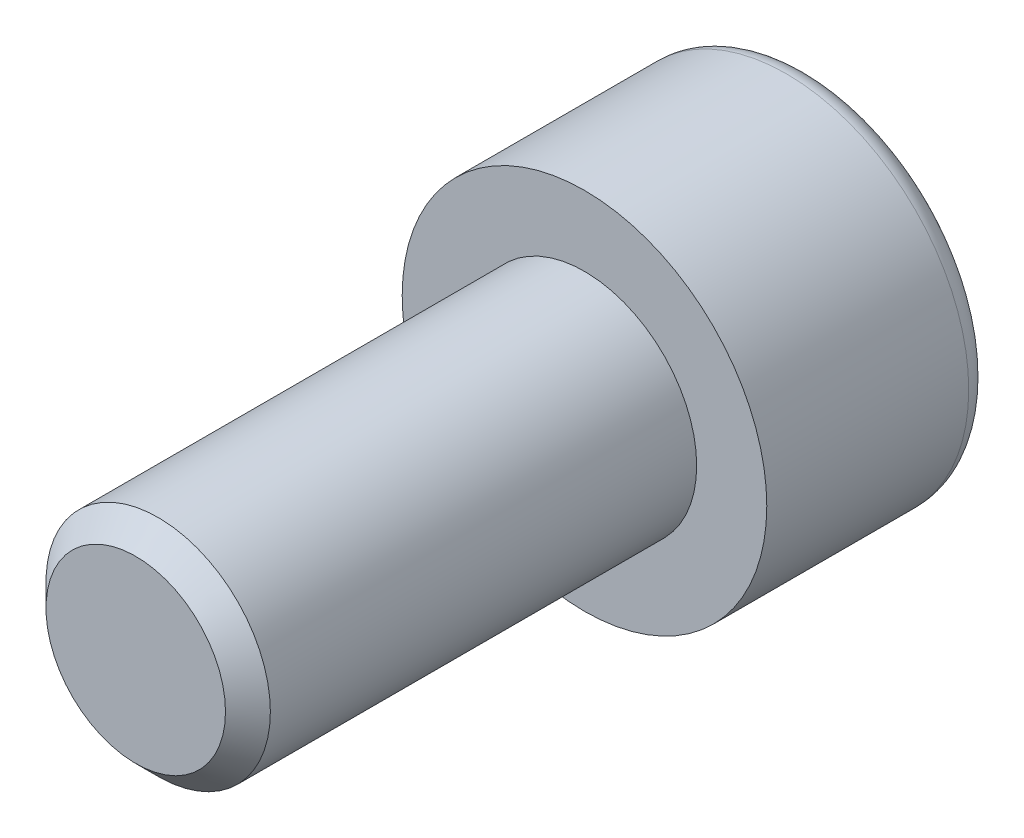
ISO-10303-21;
HEADER;
FILE_DESCRIPTION(('STEP AP214'),'2;1');
FILE_NAME('part.step','',(''),(''),'','','');
FILE_SCHEMA(('AUTOMOTIVE_DESIGN { 1 0 10303 214 1 1 1 1 }'));
ENDSEC;
DATA;
#1=APPLICATION_CONTEXT('core data for automotive mechanical design processes');
#2=APPLICATION_PROTOCOL_DEFINITION('international standard','automotive_design',2000,#1);
#3=PRODUCT_CONTEXT('',#1,'mechanical');
#4=PRODUCT('Part','Part','',(#3));
#5=PRODUCT_RELATED_PRODUCT_CATEGORY('part','',(#4));
#6=PRODUCT_DEFINITION_FORMATION('','',#4);
#7=PRODUCT_DEFINITION_CONTEXT('part definition',#1,'design');
#8=PRODUCT_DEFINITION('design','',#6,#7);
#9=PRODUCT_DEFINITION_SHAPE('','',#8);
#10=(LENGTH_UNIT() NAMED_UNIT(*) SI_UNIT(.MILLI.,.METRE.));
#11=(NAMED_UNIT(*) PLANE_ANGLE_UNIT() SI_UNIT($,.RADIAN.));
#12=(NAMED_UNIT(*) SI_UNIT($,.STERADIAN.) SOLID_ANGLE_UNIT());
#13=UNCERTAINTY_MEASURE_WITH_UNIT(LENGTH_MEASURE(1.E-05),#10,'distance_accuracy_value','');
#14=(GEOMETRIC_REPRESENTATION_CONTEXT(3) GLOBAL_UNCERTAINTY_ASSIGNED_CONTEXT((#13)) GLOBAL_UNIT_ASSIGNED_CONTEXT((#10,
#11,#12)) REPRESENTATION_CONTEXT('',''));
#15=CARTESIAN_POINT('',(0.,0.,0.));
#16=DIRECTION('',(0.,0.,1.));
#17=DIRECTION('',(1.,0.,0.));
#18=AXIS2_PLACEMENT_3D('',#15,#16,#17);
#19=CARTESIAN_POINT('',(0.,0.,-8.));
#20=DIRECTION('',(0.,0.,1.));
#21=DIRECTION('',(1.,0.,0.));
#22=AXIS2_PLACEMENT_3D('',#19,#20,#21);
#23=PLANE('',#22);
#24=CARTESIAN_POINT('',(0.,0.,-8.));
#25=DIRECTION('',(0.,0.,-1.));
#26=DIRECTION('',(-1.,0.,0.));
#27=AXIS2_PLACEMENT_3D('',#24,#25,#26);
#28=CIRCLE('',#27,5.7);
#29=CARTESIAN_POINT('',(-5.7,0.,-8.));
#30=VERTEX_POINT('',#29);
#31=EDGE_CURVE('E140',#30,#30,#28,.T.);
#32=ORIENTED_EDGE('',*,*,#31,.T.);
#33=EDGE_LOOP('',(#32));
#34=FACE_BOUND('',#33,.T.);
#35=DIRECTION('',(-0.86602540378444,0.499999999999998,0.));
#36=VECTOR('',#35,1.);
#37=CARTESIAN_POINT('',(0.,3.46410161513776,-8.));
#38=LINE('',#37,#36);
#39=CARTESIAN_POINT('',(3.,1.73205080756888,-8.));
#40=VERTEX_POINT('',#39);
#41=CARTESIAN_POINT('',(0.,3.46410161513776,-8.));
#42=VERTEX_POINT('',#41);
#43=EDGE_CURVE('E44',#40,#42,#38,.T.);
#44=ORIENTED_EDGE('',*,*,#43,.T.);
#45=DIRECTION('',(-0.866025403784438,-0.500000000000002,0.));
#46=VECTOR('',#45,1.);
#47=CARTESIAN_POINT('',(0.,3.46410161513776,-8.));
#48=LINE('',#47,#46);
#49=CARTESIAN_POINT('',(-3.,1.73205080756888,-8.));
#50=VERTEX_POINT('',#49);
#51=EDGE_CURVE('E84',#42,#50,#48,.T.);
#52=ORIENTED_EDGE('',*,*,#51,.T.);
#53=DIRECTION('',(0.,-1.,0.));
#54=VECTOR('',#53,1.);
#55=CARTESIAN_POINT('',(-3.,-1.73205080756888,-8.));
#56=LINE('',#55,#54);
#57=CARTESIAN_POINT('',(-3.,-1.73205080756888,-8.));
#58=VERTEX_POINT('',#57);
#59=EDGE_CURVE('E92',#50,#58,#56,.T.);
#60=ORIENTED_EDGE('',*,*,#59,.T.);
#61=DIRECTION('',(0.866025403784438,-0.500000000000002,0.));
#62=VECTOR('',#61,1.);
#63=CARTESIAN_POINT('',(0.,-3.46410161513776,-8.));
#64=LINE('',#63,#62);
#65=CARTESIAN_POINT('',(0.,-3.46410161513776,-8.));
#66=VERTEX_POINT('',#65);
#67=EDGE_CURVE('E110',#58,#66,#64,.T.);
#68=ORIENTED_EDGE('',*,*,#67,.T.);
#69=DIRECTION('',(0.86602540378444,0.499999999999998,0.));
#70=VECTOR('',#69,1.);
#71=CARTESIAN_POINT('',(0.,-3.46410161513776,-8.));
#72=LINE('',#71,#70);
#73=CARTESIAN_POINT('',(3.,-1.73205080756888,-8.));
#74=VERTEX_POINT('',#73);
#75=EDGE_CURVE('E113',#66,#74,#72,.T.);
#76=ORIENTED_EDGE('',*,*,#75,.T.);
#77=DIRECTION('',(0.,1.,0.));
#78=VECTOR('',#77,1.);
#79=CARTESIAN_POINT('',(3.,-1.73205080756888,-8.));
#80=LINE('',#79,#78);
#81=EDGE_CURVE('E103',#74,#40,#80,.T.);
#82=ORIENTED_EDGE('',*,*,#81,.T.);
#83=EDGE_LOOP('',(#44,#52,#60,#68,#76,#82));
#84=FACE_BOUND('',#83,.T.);
#85=ADVANCED_FACE('F30',(#34,#84),#23,.F.);
#86=CARTESIAN_POINT('',(0.,0.,-7.2));
#87=DIRECTION('',(0.,0.,-1.));
#88=DIRECTION('',(-1.,0.,0.));
#89=AXIS2_PLACEMENT_3D('',#86,#87,#88);
#90=TOROIDAL_SURFACE('',#89,5.7,0.8);
#91=ORIENTED_EDGE('',*,*,#31,.F.);
#92=EDGE_LOOP('',(#91));
#93=FACE_BOUND('',#92,.T.);
#94=CARTESIAN_POINT('',(0.,0.,-7.2));
#95=DIRECTION('',(0.,0.,-1.));
#96=DIRECTION('',(-1.,0.,0.));
#97=AXIS2_PLACEMENT_3D('',#94,#95,#96);
#98=CIRCLE('',#97,6.5);
#99=CARTESIAN_POINT('',(-6.5,0.,-7.2));
#100=VERTEX_POINT('',#99);
#101=EDGE_CURVE('E137',#100,#100,#98,.T.);
#102=ORIENTED_EDGE('',*,*,#101,.T.);
#103=EDGE_LOOP('',(#102));
#104=FACE_BOUND('',#103,.T.);
#105=ADVANCED_FACE('F159',(#93,#104),#90,.T.);
#106=CARTESIAN_POINT('',(0.,0.,0.));
#107=DIRECTION('',(0.,0.,-1.));
#108=DIRECTION('',(-1.,0.,0.));
#109=AXIS2_PLACEMENT_3D('',#106,#107,#108);
#110=CYLINDRICAL_SURFACE('',#109,6.5);
#111=ORIENTED_EDGE('',*,*,#101,.F.);
#112=EDGE_LOOP('',(#111));
#113=FACE_BOUND('',#112,.T.);
#114=CARTESIAN_POINT('',(0.,0.,0.));
#115=DIRECTION('',(0.,0.,-1.));
#116=DIRECTION('',(-1.,0.,0.));
#117=AXIS2_PLACEMENT_3D('',#114,#115,#116);
#118=CIRCLE('',#117,6.5);
#119=CARTESIAN_POINT('',(-6.5,0.,0.));
#120=VERTEX_POINT('',#119);
#121=EDGE_CURVE('E98',#120,#120,#118,.T.);
#122=ORIENTED_EDGE('',*,*,#121,.T.);
#123=EDGE_LOOP('',(#122));
#124=FACE_BOUND('',#123,.T.);
#125=ADVANCED_FACE('F164',(#113,#124),#110,.T.);
#126=CARTESIAN_POINT('',(0.,0.,0.));
#127=DIRECTION('',(0.,0.,-1.));
#128=DIRECTION('',(-1.,0.,0.));
#129=AXIS2_PLACEMENT_3D('',#126,#127,#128);
#130=PLANE('',#129);
#131=CARTESIAN_POINT('',(0.,0.,0.));
#132=DIRECTION('',(0.,0.,1.));
#133=DIRECTION('',(1.,0.,0.));
#134=AXIS2_PLACEMENT_3D('',#131,#132,#133);
#135=CIRCLE('',#134,4.);
#136=CARTESIAN_POINT('',(4.,0.,0.));
#137=VERTEX_POINT('',#136);
#138=EDGE_CURVE('E104',#137,#137,#135,.T.);
#139=ORIENTED_EDGE('',*,*,#138,.F.);
#140=EDGE_LOOP('',(#139));
#141=FACE_BOUND('',#140,.T.);
#142=ORIENTED_EDGE('',*,*,#121,.F.);
#143=EDGE_LOOP('',(#142));
#144=FACE_BOUND('',#143,.T.);
#145=ADVANCED_FACE('F172',(#141,#144),#130,.F.);
#146=CARTESIAN_POINT('',(0.,3.46410161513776,-4.));
#147=DIRECTION('',(-0.499999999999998,-0.86602540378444,0.));
#148=DIRECTION('',(0.86602540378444,-0.499999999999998,0.));
#149=AXIS2_PLACEMENT_3D('',#146,#147,#148);
#150=PLANE('',#149);
#151=ORIENTED_EDGE('',*,*,#43,.F.);
#152=DIRECTION('',(0.,0.,-1.));
#153=VECTOR('',#152,1.);
#154=CARTESIAN_POINT('',(3.,1.73205080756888,-4.));
#155=LINE('',#154,#153);
#156=CARTESIAN_POINT('',(3.,1.73205080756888,-4.));
#157=VERTEX_POINT('',#156);
#158=EDGE_CURVE('E126',#157,#40,#155,.T.);
#159=ORIENTED_EDGE('',*,*,#158,.F.);
#160=DIRECTION('',(-0.86602540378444,0.499999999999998,0.));
#161=VECTOR('',#160,1.);
#162=CARTESIAN_POINT('',(0.,3.46410161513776,-4.));
#163=LINE('',#162,#161);
#164=CARTESIAN_POINT('',(0.,3.46410161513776,-4.));
#165=VERTEX_POINT('',#164);
#166=EDGE_CURVE('E97',#157,#165,#163,.T.);
#167=ORIENTED_EDGE('',*,*,#166,.T.);
#168=DIRECTION('',(0.,0.,-1.));
#169=VECTOR('',#168,1.);
#170=CARTESIAN_POINT('',(0.,3.46410161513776,-4.));
#171=LINE('',#170,#169);
#172=EDGE_CURVE('E86',#165,#42,#171,.T.);
#173=ORIENTED_EDGE('',*,*,#172,.T.);
#174=EDGE_LOOP('',(#151,#159,#167,#173));
#175=FACE_BOUND('',#174,.T.);
#176=ADVANCED_FACE('F95',(#175),#150,.T.);
#177=CARTESIAN_POINT('',(0.,3.46410161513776,-4.));
#178=DIRECTION('',(0.500000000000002,-0.866025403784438,0.));
#179=DIRECTION('',(0.866025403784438,0.500000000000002,0.));
#180=AXIS2_PLACEMENT_3D('',#177,#178,#179);
#181=PLANE('',#180);
#182=ORIENTED_EDGE('',*,*,#51,.F.);
#183=ORIENTED_EDGE('',*,*,#172,.F.);
#184=DIRECTION('',(-0.866025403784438,-0.500000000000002,0.));
#185=VECTOR('',#184,1.);
#186=CARTESIAN_POINT('',(0.,3.46410161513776,-4.));
#187=LINE('',#186,#185);
#188=CARTESIAN_POINT('',(-3.,1.73205080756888,-4.));
#189=VERTEX_POINT('',#188);
#190=EDGE_CURVE('E117',#165,#189,#187,.T.);
#191=ORIENTED_EDGE('',*,*,#190,.T.);
#192=DIRECTION('',(0.,0.,-1.));
#193=VECTOR('',#192,1.);
#194=CARTESIAN_POINT('',(-3.,1.73205080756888,-4.));
#195=LINE('',#194,#193);
#196=EDGE_CURVE('E88',#189,#50,#195,.T.);
#197=ORIENTED_EDGE('',*,*,#196,.T.);
#198=EDGE_LOOP('',(#182,#183,#191,#197));
#199=FACE_BOUND('',#198,.T.);
#200=ADVANCED_FACE('F85',(#199),#181,.T.);
#201=CARTESIAN_POINT('',(-3.,-1.73205080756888,-4.));
#202=DIRECTION('',(1.,0.,0.));
#203=DIRECTION('',(0.,0.,-1.));
#204=AXIS2_PLACEMENT_3D('',#201,#202,#203);
#205=PLANE('',#204);
#206=ORIENTED_EDGE('',*,*,#59,.F.);
#207=ORIENTED_EDGE('',*,*,#196,.F.);
#208=DIRECTION('',(0.,-1.,0.));
#209=VECTOR('',#208,1.);
#210=CARTESIAN_POINT('',(-3.,-1.73205080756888,-4.));
#211=LINE('',#210,#209);
#212=CARTESIAN_POINT('',(-3.,-1.73205080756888,-4.));
#213=VERTEX_POINT('',#212);
#214=EDGE_CURVE('E119',#189,#213,#211,.T.);
#215=ORIENTED_EDGE('',*,*,#214,.T.);
#216=DIRECTION('',(0.,0.,-1.));
#217=VECTOR('',#216,1.);
#218=CARTESIAN_POINT('',(-3.,-1.73205080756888,-4.));
#219=LINE('',#218,#217);
#220=EDGE_CURVE('E132',#213,#58,#219,.T.);
#221=ORIENTED_EDGE('',*,*,#220,.T.);
#222=EDGE_LOOP('',(#206,#207,#215,#221));
#223=FACE_BOUND('',#222,.T.);
#224=ADVANCED_FACE('F187',(#223),#205,.T.);
#225=CARTESIAN_POINT('',(0.,-3.46410161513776,-4.));
#226=DIRECTION('',(0.500000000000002,0.866025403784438,0.));
#227=DIRECTION('',(-0.866025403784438,0.500000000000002,0.));
#228=AXIS2_PLACEMENT_3D('',#225,#226,#227);
#229=PLANE('',#228);
#230=ORIENTED_EDGE('',*,*,#67,.F.);
#231=ORIENTED_EDGE('',*,*,#220,.F.);
#232=DIRECTION('',(0.866025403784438,-0.500000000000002,0.));
#233=VECTOR('',#232,1.);
#234=CARTESIAN_POINT('',(0.,-3.46410161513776,-4.));
#235=LINE('',#234,#233);
#236=CARTESIAN_POINT('',(0.,-3.46410161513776,-4.));
#237=VERTEX_POINT('',#236);
#238=EDGE_CURVE('E121',#213,#237,#235,.T.);
#239=ORIENTED_EDGE('',*,*,#238,.T.);
#240=DIRECTION('',(0.,0.,-1.));
#241=VECTOR('',#240,1.);
#242=CARTESIAN_POINT('',(0.,-3.46410161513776,-4.));
#243=LINE('',#242,#241);
#244=EDGE_CURVE('E130',#237,#66,#243,.T.);
#245=ORIENTED_EDGE('',*,*,#244,.T.);
#246=EDGE_LOOP('',(#230,#231,#239,#245));
#247=FACE_BOUND('',#246,.T.);
#248=ADVANCED_FACE('F190',(#247),#229,.T.);
#249=CARTESIAN_POINT('',(0.,-3.46410161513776,-4.));
#250=DIRECTION('',(-0.499999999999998,0.86602540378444,0.));
#251=DIRECTION('',(-0.86602540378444,-0.499999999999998,0.));
#252=AXIS2_PLACEMENT_3D('',#249,#250,#251);
#253=PLANE('',#252);
#254=ORIENTED_EDGE('',*,*,#75,.F.);
#255=ORIENTED_EDGE('',*,*,#244,.F.);
#256=DIRECTION('',(0.86602540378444,0.499999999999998,0.));
#257=VECTOR('',#256,1.);
#258=CARTESIAN_POINT('',(0.,-3.46410161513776,-4.));
#259=LINE('',#258,#257);
#260=CARTESIAN_POINT('',(3.,-1.73205080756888,-4.));
#261=VERTEX_POINT('',#260);
#262=EDGE_CURVE('E123',#237,#261,#259,.T.);
#263=ORIENTED_EDGE('',*,*,#262,.T.);
#264=DIRECTION('',(0.,0.,-1.));
#265=VECTOR('',#264,1.);
#266=CARTESIAN_POINT('',(3.,-1.73205080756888,-4.));
#267=LINE('',#266,#265);
#268=EDGE_CURVE('E128',#261,#74,#267,.T.);
#269=ORIENTED_EDGE('',*,*,#268,.T.);
#270=EDGE_LOOP('',(#254,#255,#263,#269));
#271=FACE_BOUND('',#270,.T.);
#272=ADVANCED_FACE('F194',(#271),#253,.T.);
#273=CARTESIAN_POINT('',(3.,-1.73205080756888,-4.));
#274=DIRECTION('',(-1.,0.,0.));
#275=DIRECTION('',(0.,0.,1.));
#276=AXIS2_PLACEMENT_3D('',#273,#274,#275);
#277=PLANE('',#276);
#278=ORIENTED_EDGE('',*,*,#81,.F.);
#279=ORIENTED_EDGE('',*,*,#268,.F.);
#280=DIRECTION('',(0.,1.,0.));
#281=VECTOR('',#280,1.);
#282=CARTESIAN_POINT('',(3.,-1.73205080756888,-4.));
#283=LINE('',#282,#281);
#284=EDGE_CURVE('E51',#261,#157,#283,.T.);
#285=ORIENTED_EDGE('',*,*,#284,.T.);
#286=ORIENTED_EDGE('',*,*,#158,.T.);
#287=EDGE_LOOP('',(#278,#279,#285,#286));
#288=FACE_BOUND('',#287,.T.);
#289=ADVANCED_FACE('F198',(#288),#277,.T.);
#290=CARTESIAN_POINT('',(3.,1.73205080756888,-4.));
#291=DIRECTION('',(0.,0.,1.));
#292=DIRECTION('',(1.,0.,0.));
#293=AXIS2_PLACEMENT_3D('',#290,#291,#292);
#294=PLANE('',#293);
#295=ORIENTED_EDGE('',*,*,#166,.F.);
#296=ORIENTED_EDGE('',*,*,#284,.F.);
#297=ORIENTED_EDGE('',*,*,#262,.F.);
#298=ORIENTED_EDGE('',*,*,#238,.F.);
#299=ORIENTED_EDGE('',*,*,#214,.F.);
#300=ORIENTED_EDGE('',*,*,#190,.F.);
#301=EDGE_LOOP('',(#295,#296,#297,#298,#299,#300));
#302=FACE_BOUND('',#301,.T.);
#303=ADVANCED_FACE('F202',(#302),#294,.F.);
#304=CARTESIAN_POINT('',(0.,0.,16.));
#305=DIRECTION('',(0.,0.,1.));
#306=DIRECTION('',(1.,0.,0.));
#307=AXIS2_PLACEMENT_3D('',#304,#305,#306);
#308=PLANE('',#307);
#309=CARTESIAN_POINT('',(0.,0.,16.));
#310=DIRECTION('',(0.,0.,1.));
#311=DIRECTION('',(1.,0.,0.));
#312=AXIS2_PLACEMENT_3D('',#309,#310,#311);
#313=CIRCLE('',#312,3.2);
#314=CARTESIAN_POINT('',(3.2,0.,16.));
#315=VERTEX_POINT('',#314);
#316=EDGE_CURVE('E37',#315,#315,#313,.T.);
#317=ORIENTED_EDGE('',*,*,#316,.T.);
#318=EDGE_LOOP('',(#317));
#319=FACE_BOUND('',#318,.T.);
#320=ADVANCED_FACE('F145',(#319),#308,.T.);
#321=CARTESIAN_POINT('',(0.,0.,0.));
#322=DIRECTION('',(0.,0.,1.));
#323=DIRECTION('',(1.,0.,0.));
#324=AXIS2_PLACEMENT_3D('',#321,#322,#323);
#325=CYLINDRICAL_SURFACE('',#324,4.);
#326=CARTESIAN_POINT('',(0.,0.,15.2));
#327=DIRECTION('',(0.,0.,1.));
#328=DIRECTION('',(1.,0.,0.));
#329=AXIS2_PLACEMENT_3D('',#326,#327,#328);
#330=CIRCLE('',#329,4.);
#331=CARTESIAN_POINT('',(4.,0.,15.2));
#332=VERTEX_POINT('',#331);
#333=EDGE_CURVE('E11',#332,#332,#330,.F.);
#334=ORIENTED_EDGE('',*,*,#333,.T.);
#335=EDGE_LOOP('',(#334));
#336=FACE_BOUND('',#335,.T.);
#337=ORIENTED_EDGE('',*,*,#138,.T.);
#338=EDGE_LOOP('',(#337));
#339=FACE_BOUND('',#338,.T.);
#340=ADVANCED_FACE('F149',(#336,#339),#325,.T.);
#341=CARTESIAN_POINT('',(0.,0.,16.));
#342=DIRECTION('',(0.,0.,-1.));
#343=DIRECTION('',(-1.,0.,0.));
#344=AXIS2_PLACEMENT_3D('',#341,#342,#343);
#345=CONICAL_SURFACE('',#344,3.2,0.785398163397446);
#346=ORIENTED_EDGE('',*,*,#333,.F.);
#347=EDGE_LOOP('',(#346));
#348=FACE_BOUND('',#347,.T.);
#349=ORIENTED_EDGE('',*,*,#316,.F.);
#350=EDGE_LOOP('',(#349));
#351=FACE_BOUND('',#350,.T.);
#352=ADVANCED_FACE('F147',(#348,#351),#345,.T.);
#353=CLOSED_SHELL('',(#85,#105,#125,#145,#176,#200,#224,#248,#272,#289,#303,#320,#340,#352));
#354=MANIFOLD_SOLID_BREP('B2',#353);
#355=ADVANCED_BREP_SHAPE_REPRESENTATION('',(#18,#354),#14);
#356=SHAPE_DEFINITION_REPRESENTATION(#9,#355);
ENDSEC;
END-ISO-10303-21;
